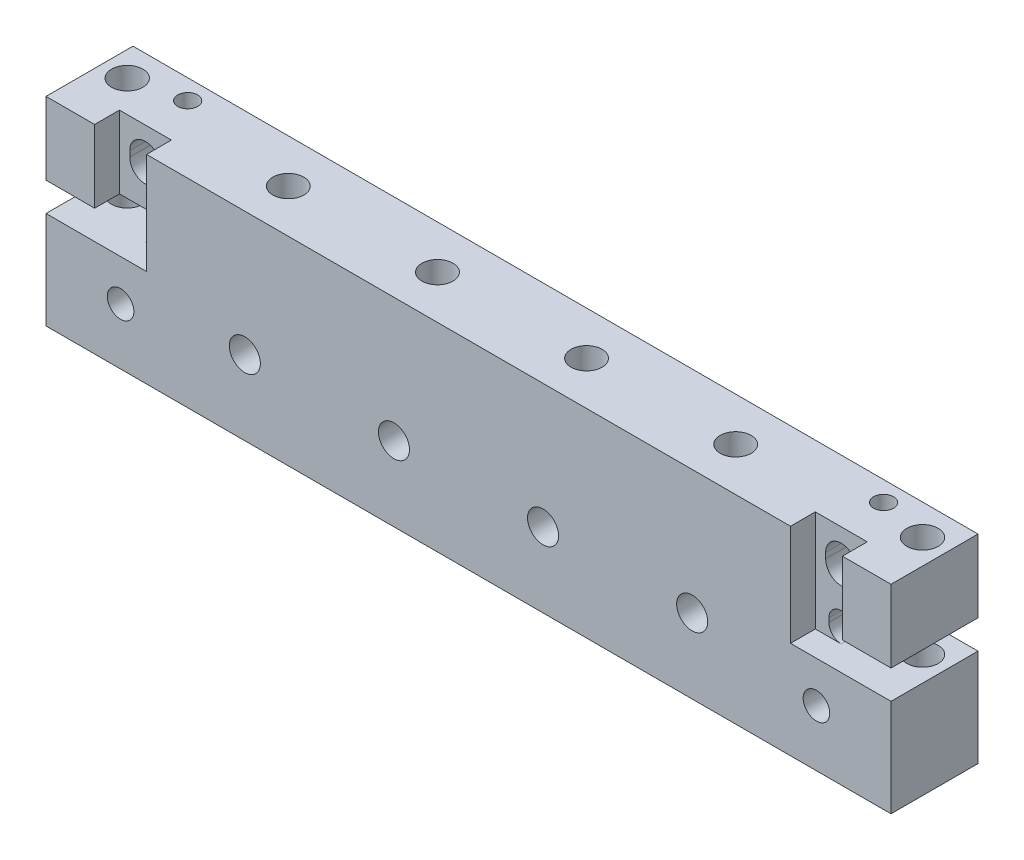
from build123d import *

# Parameters (mm, degrees)
SKETCH1_W                    = 215.9
SKETCH1_H                    = 50.8
EXTRUDE1_DEPTH               = 22.225
CLEARANCE_SLOT_DEPTH         = 223.906708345
M8X1_25_TAPPED_HOLE1_D       = 6.8
F_3_8_16_TAPPED_HOLE4_D      = 7.9375
F_3_8_16_TAPPED_HOLE4_DEPTH  = 23.8252
F_3_8_16_TAPPED_HOLE4_TIP    = 2.384665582
CUT_EXTRUDE2_DEPTH           = 223.906708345
CUT_EXTRUDE3_DEPTH           = 6.35
F_3_8_16_TAPPED_HOLE5_D      = 7.9375
F_1_4_20_TAPPED_HOLE1_REACH  = 224.907
F_1_4_20_TAPPED_HOLE1_BORE_R = 2.5527
O_0_316_DIAMETER_HOLE3_D     = 8.0264


with BuildPart() as part:
    # Sketch1 → Extrude1 (new body)
    with BuildSketch(Plane.XY):
        with Locations((107.95, 25.4)):
            Rectangle(SKETCH1_W, SKETCH1_H)
    extrude(amount=EXTRUDE1_DEPTH)

    # Sketch2 → Clearance Slot (cut, through all)
    with BuildSketch(Plane.XY.offset(22.225)):
        with BuildLine():
            Line((215.9, 32.258), (196.85, 32.258))
            ThreePointArc((196.85, 32.258), (194.60493597, 31.32806403), (193.675, 29.083))
            Line((193.675, 29.083), (193.675, 28.067))
            ThreePointArc((193.675, 28.067), (194.60493597, 25.82193597), (196.85, 24.892))
            Line((196.85, 24.892), (215.9, 24.892))
            Line((215.9, 24.892), (215.9, 32.258))
        make_face()
        with BuildLine():
            Line((22.225, 29.083), (22.225, 28.067))
            ThreePointArc((22.225, 28.067), (21.29506403, 25.82193597), (19.05, 24.892))
            Line((19.05, 24.892), (0, 24.892))
            Line((0, 24.892), (0, 32.258))
            Line((0, 32.258), (19.05, 32.258))
            ThreePointArc((19.05, 32.258), (21.29506403, 31.32806403), (22.225, 29.083))
        make_face()
    extrude(amount=-CLEARANCE_SLOT_DEPTH, mode=Mode.SUBTRACT)

    # M8x1.25 Tapped Hole1 (through all)
    with Locations(Plane.XY.offset(22.225)):
        with Locations((196.85, 14.4), (19.05, 14.4)):
            Hole(M8X1_25_TAPPED_HOLE1_D / 2)

    # 3_8-16 Tapped Hole4
    with Locations(Plane.XY.offset(22.225)):
        with Locations((88.9, 19.05), (127, 19.05), (165.1, 19.05), (50.8, 19.05)):
            Hole(F_3_8_16_TAPPED_HOLE4_D / 2, depth=F_3_8_16_TAPPED_HOLE4_DEPTH)
            with Locations((0, 0, -(F_3_8_16_TAPPED_HOLE4_DEPTH + F_3_8_16_TAPPED_HOLE4_TIP / 2))):  # 118° drill point
                Cone(0, F_3_8_16_TAPPED_HOLE4_D / 2, F_3_8_16_TAPPED_HOLE4_TIP, mode=Mode.SUBTRACT)

    # Sketch10 → Cut-Extrude2 (cut, through all)
    with BuildSketch(Plane.XY.offset(22.225)):
        with BuildLine():
            Line((23.05, 41.75), (23.05, 43.18))
            ThreePointArc((23.05, 43.18), (19.05, 47.18), (15.05, 43.18))
            Line((15.05, 43.18), (15.05, 41.75))
            ThreePointArc((15.05, 41.75), (19.05, 37.75), (23.05, 41.75))
        make_face()
        with BuildLine():
            Line((200.85, 41.75), (200.85, 43.18))
            ThreePointArc((200.85, 43.18), (196.85, 47.18), (192.85, 43.18))
            Line((192.85, 43.18), (192.85, 41.75))
            ThreePointArc((192.85, 41.75), (196.85, 37.75), (200.85, 41.75))
        make_face()
    extrude(amount=-CUT_EXTRUDE2_DEPTH, mode=Mode.SUBTRACT)

    # Sketch11 → Cut-Extrude3 (cut)
    with BuildSketch(Plane.XY.offset(22.225)):
        with BuildLine():
            Line((12.4206, 50.8), (25.6794, 50.8))
            Line((25.6794, 50.8), (25.6794, 24.892))
            Line((25.6794, 24.892), (18.7706, 24.892))
            ThreePointArc((18.7706, 24.892), (14.280471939, 26.751871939), (12.4206, 31.242))
            Line((12.4206, 31.242), (12.4206, 50.8))
        make_face()
        with BuildLine():
            Line((190.2206, 50.8), (190.2206, 24.892))
            Line((190.2206, 24.892), (197.1294, 24.892))
            ThreePointArc((197.1294, 24.892), (201.619528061, 26.751871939), (203.4794, 31.242))
            Line((203.4794, 31.242), (203.4794, 50.8))
            Line((203.4794, 50.8), (190.2206, 50.8))
        make_face()
    extrude(amount=-CUT_EXTRUDE3_DEPTH, mode=Mode.SUBTRACT)

    # 3_8-16 Tapped Hole5 (through all)
    with Locations(Plane(origin=(0, 50.8, 0), x_dir=(-1, 0, 0), z_dir=(0, 1, 0))):
        with Locations((-127, 11.1125), (-88.9, 11.1125), (-165.1, 11.1125), (-50.8, 11.1125)):
            Hole(F_3_8_16_TAPPED_HOLE5_D / 2)

    # 1_4-20 Tapped Hole1 bore → 1_4-20 Tapped Hole1 (cut, up to next)
    with BuildSketch(Plane(origin=(0, 50.8, 0), x_dir=(-1, 0, 0), z_dir=(0, 1, 0)), mode=Mode.PRIVATE) as f_1_4_20_tapped_hole1_sk1:
        with Locations((-19.05, 5.08)):
            Circle(F_1_4_20_TAPPED_HOLE1_BORE_R)
    f_1_4_20_tapped_hole1_tool1 = extrude(f_1_4_20_tapped_hole1_sk1.sketch, amount=-F_1_4_20_TAPPED_HOLE1_REACH, mode=Mode.PRIVATE) & part.part
    # 1_4-20 Tapped Hole1 bore → 1_4-20 Tapped Hole1 (cut, up to next)
    with BuildSketch(Plane(origin=(0, 50.8, 0), x_dir=(-1, 0, 0), z_dir=(0, 1, 0)), mode=Mode.PRIVATE) as f_1_4_20_tapped_hole1_sk2:
        with Locations((-196.85, 5.08)):
            Circle(F_1_4_20_TAPPED_HOLE1_BORE_R)
    f_1_4_20_tapped_hole1_tool2 = extrude(f_1_4_20_tapped_hole1_sk2.sketch, amount=-F_1_4_20_TAPPED_HOLE1_REACH, mode=Mode.PRIVATE) & part.part
    add(f_1_4_20_tapped_hole1_tool1.solids().sort_by_distance((19.05, 50.8, 5.08))[0], mode=Mode.SUBTRACT)
    add(f_1_4_20_tapped_hole1_tool2.solids().sort_by_distance((196.85, 50.8, 5.08))[0], mode=Mode.SUBTRACT)

    # O _0.316_ Diameter Hole3 (through all)
    with Locations(Plane(origin=(0, 50.8, 0), x_dir=(-1, 0, 0), z_dir=(0, 1, 0))):
        with Locations((-6.35, 7.8232), (-209.55, 7.8232)):
            Hole(O_0_316_DIAMETER_HOLE3_D / 2)


solid = part.part
